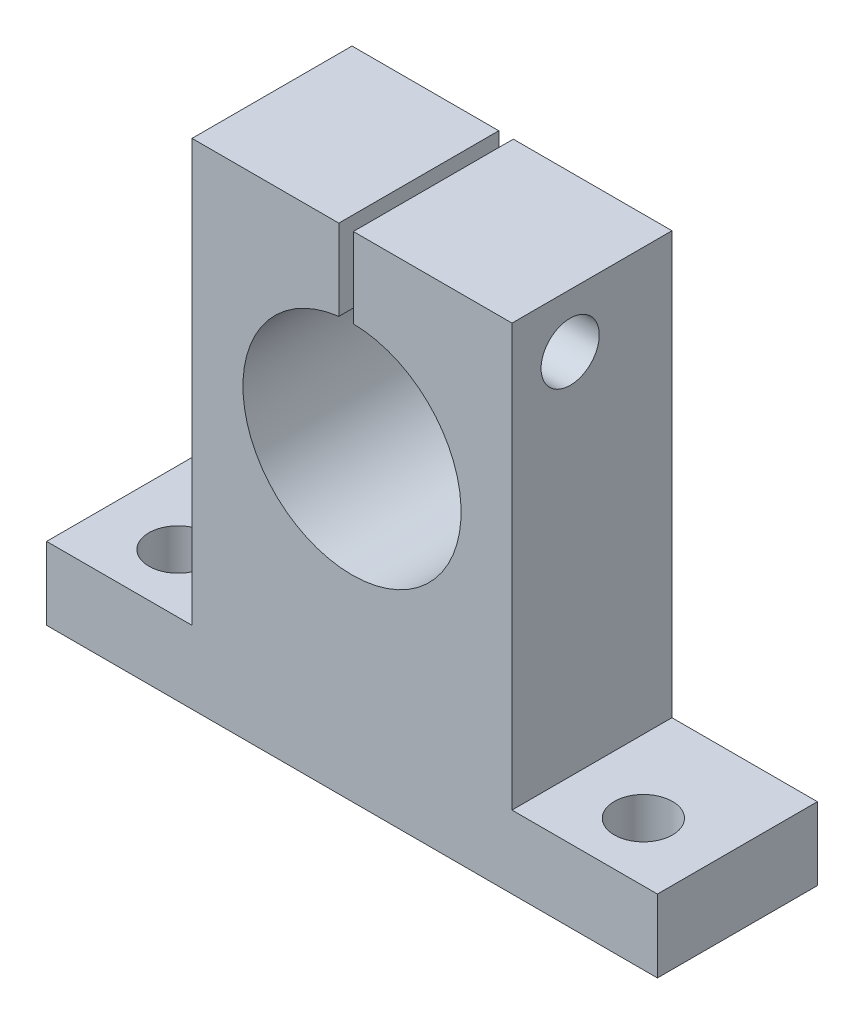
from build123d import *

# Parameters (mm, degrees)
BOSS_EXTRUDE1_DEPTH       = 22
CUT_EXTRUDE1_DEPTH        = 90.849500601
F_8_0MM_DOWEL_SLOT1_D     = 8
F_8_0MM_DOWEL_SLOT1_DEPTH = 20
F_8_0MM_DOWEL_SLOT1_TIP   = 2.403442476
F_8_0MM_DOWEL_SLOT2_D     = 8
F_8_0MM_DOWEL_SLOT2_DEPTH = 50
F_8_0MM_DOWEL_SLOT2_TIP   = 2.403442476


with BuildPart() as part:
    # Sketch1 → Boss-Extrude1 (new body)
    with BuildSketch(Plane.XY):
        Polygon((44.681248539, 0.354681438), (64.681248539, 0.354681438), (64.681248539, -9.645318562), (-19.318751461, -9.645318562), (-19.318751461, 0.354681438), (0.681248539, 0.354681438), (0.681248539, 58.354681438), (44.681248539, 58.354681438), align=None)
    extrude(amount=BOSS_EXTRUDE1_DEPTH)

    # Sketch2 → Cut-Extrude1 (cut, through all)
    with BuildSketch(Plane.XY.offset(22)):
        with BuildLine():
            Line((20.865399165, 58.161618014), (20.865399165, 58.354681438))
            Line((20.865399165, 58.354681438), (22.865399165, 58.354681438))
            Line((22.865399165, 58.354681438), (22.865399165, 58.161618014))
            Line((22.865399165, 58.161618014), (22.865399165, 47.353551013))
            ThreePointArc((22.865399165, 47.353551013), (23.498922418, 17.376984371), (20.865399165, 47.244365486))
            Line((20.865399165, 47.244365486), (20.865399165, 58.161618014))
        make_face()
    extrude(amount=-CUT_EXTRUDE1_DEPTH, mode=Mode.SUBTRACT)

    # 8.0mm Dowel Slot1
    with Locations(Plane(origin=(0, 0.354681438, 0), x_dir=(1, 0, 0), z_dir=(0, 1, 0))):
        with Locations((-9.318751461, -13.932588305), (54.681248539, -13.932588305)):
            Hole(F_8_0MM_DOWEL_SLOT1_D / 2, depth=F_8_0MM_DOWEL_SLOT1_DEPTH)
            with Locations((0, 0, -(F_8_0MM_DOWEL_SLOT1_DEPTH + F_8_0MM_DOWEL_SLOT1_TIP / 2))):  # 118° drill point
                Cone(0, F_8_0MM_DOWEL_SLOT1_D / 2, F_8_0MM_DOWEL_SLOT1_TIP, mode=Mode.SUBTRACT)

    # 8.0mm Dowel Slot2
    with Locations(Plane.ZY.offset(-0.681248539)):
        with Locations((14, 50.938482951)):
            Hole(F_8_0MM_DOWEL_SLOT2_D / 2, depth=F_8_0MM_DOWEL_SLOT2_DEPTH)
            with Locations((0, 0, -(F_8_0MM_DOWEL_SLOT2_DEPTH + F_8_0MM_DOWEL_SLOT2_TIP / 2))):  # 118° drill point
                Cone(0, F_8_0MM_DOWEL_SLOT2_D / 2, F_8_0MM_DOWEL_SLOT2_TIP, mode=Mode.SUBTRACT)


solid = part.part
